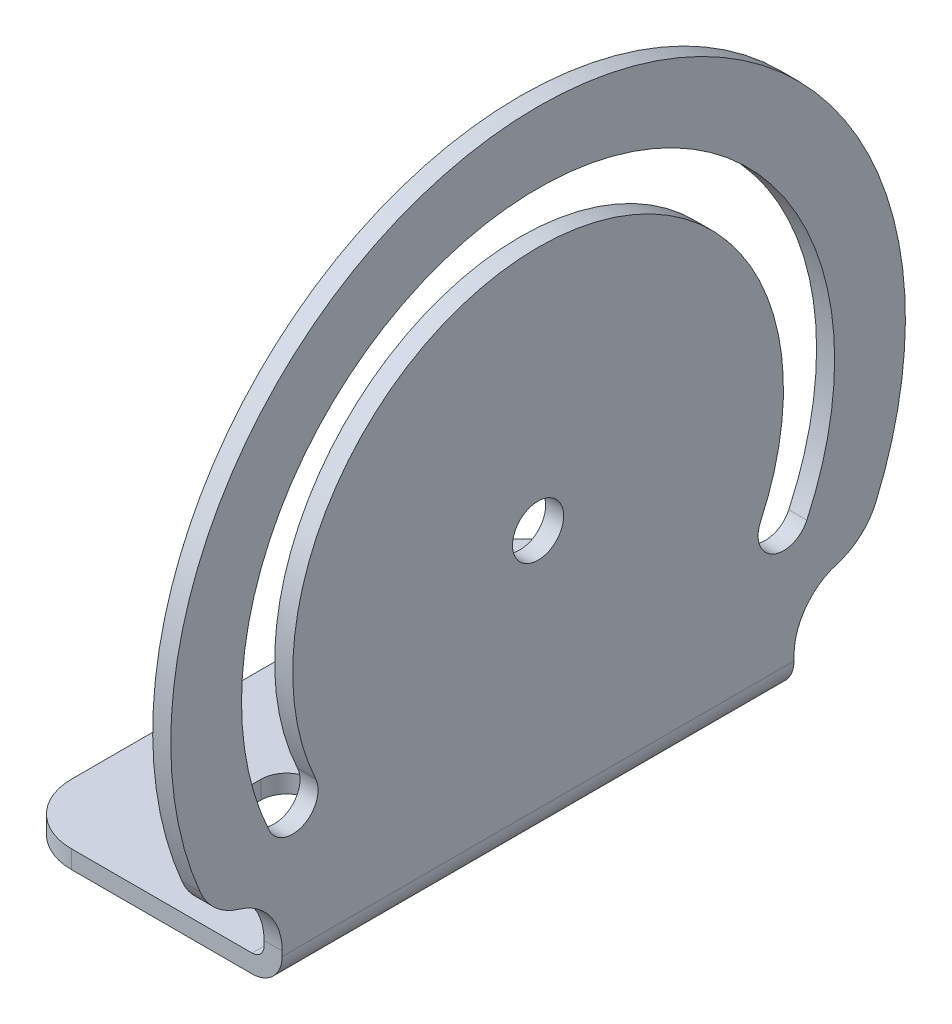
ISO-10303-21;
HEADER;
FILE_DESCRIPTION(('STEP AP214'),'2;1');
FILE_NAME('part.step','',(''),(''),'','','');
FILE_SCHEMA(('AUTOMOTIVE_DESIGN { 1 0 10303 214 1 1 1 1 }'));
ENDSEC;
DATA;
#1=APPLICATION_CONTEXT('core data for automotive mechanical design processes');
#2=APPLICATION_PROTOCOL_DEFINITION('international standard','automotive_design',2000,#1);
#3=PRODUCT_CONTEXT('',#1,'mechanical');
#4=PRODUCT('Part','Part','',(#3));
#5=PRODUCT_RELATED_PRODUCT_CATEGORY('part','',(#4));
#6=PRODUCT_DEFINITION_FORMATION('','',#4);
#7=PRODUCT_DEFINITION_CONTEXT('part definition',#1,'design');
#8=PRODUCT_DEFINITION('design','',#6,#7);
#9=PRODUCT_DEFINITION_SHAPE('','',#8);
#10=(LENGTH_UNIT() NAMED_UNIT(*) SI_UNIT(.MILLI.,.METRE.));
#11=(NAMED_UNIT(*) PLANE_ANGLE_UNIT() SI_UNIT($,.RADIAN.));
#12=(NAMED_UNIT(*) SI_UNIT($,.STERADIAN.) SOLID_ANGLE_UNIT());
#13=UNCERTAINTY_MEASURE_WITH_UNIT(LENGTH_MEASURE(1.E-05),#10,'distance_accuracy_value','');
#14=(GEOMETRIC_REPRESENTATION_CONTEXT(3) GLOBAL_UNCERTAINTY_ASSIGNED_CONTEXT((#13)) GLOBAL_UNIT_ASSIGNED_CONTEXT((#10,
#11,#12)) REPRESENTATION_CONTEXT('',''));
#15=CARTESIAN_POINT('',(0.,0.,0.));
#16=DIRECTION('',(0.,0.,1.));
#17=DIRECTION('',(1.,0.,0.));
#18=AXIS2_PLACEMENT_3D('',#15,#16,#17);
#19=CARTESIAN_POINT('',(-19.4999609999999,53.9776668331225,137.759426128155));
#20=DIRECTION('',(-1.,0.,0.));
#21=DIRECTION('',(0.,0.,1.));
#22=AXIS2_PLACEMENT_3D('',#19,#20,#21);
#23=PLANE('',#22);
#24=DIRECTION('',(0.,1.,0.));
#25=VECTOR('',#24,1.);
#26=CARTESIAN_POINT('',(-19.4999609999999,43.9776868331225,127.759446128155));
#27=LINE('',#26,#25);
#28=CARTESIAN_POINT('',(-19.4999609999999,46.9776808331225,127.759446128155));
#29=VERTEX_POINT('',#28);
#30=CARTESIAN_POINT('',(-19.4999609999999,43.9776868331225,127.759446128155));
#31=VERTEX_POINT('',#30);
#32=EDGE_CURVE('E237',#29,#31,#27,.F.);
#33=ORIENTED_EDGE('',*,*,#32,.F.);
#34=DIRECTION('',(0.,0.,1.));
#35=VECTOR('',#34,1.);
#36=CARTESIAN_POINT('',(-19.4999609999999,46.9776808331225,95.2595111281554));
#37=LINE('',#36,#35);
#38=CARTESIAN_POINT('',(-19.4999609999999,46.9776808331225,62.7595761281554));
#39=VERTEX_POINT('',#38);
#40=EDGE_CURVE('E296',#39,#29,#37,.T.);
#41=ORIENTED_EDGE('',*,*,#40,.F.);
#42=DIRECTION('',(0.,1.,0.));
#43=VECTOR('',#42,1.);
#44=CARTESIAN_POINT('',(-19.4999609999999,53.9776668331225,62.7595761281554));
#45=LINE('',#44,#43);
#46=CARTESIAN_POINT('',(-19.4999609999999,43.9776868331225,62.7595761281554));
#47=VERTEX_POINT('',#46);
#48=EDGE_CURVE('E239',#47,#39,#45,.T.);
#49=ORIENTED_EDGE('',*,*,#48,.F.);
#50=DIRECTION('',(0.,0.,1.));
#51=VECTOR('',#50,1.);
#52=CARTESIAN_POINT('',(-19.4999609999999,43.9776868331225,95.2595111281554));
#53=LINE('',#52,#51);
#54=EDGE_CURVE('E234',#47,#31,#53,.T.);
#55=ORIENTED_EDGE('',*,*,#54,.T.);
#56=EDGE_LOOP('',(#33,#41,#49,#55));
#57=FACE_BOUND('',#56,.T.);
#58=ADVANCED_FACE('F16',(#57),#23,.T.);
#59=CARTESIAN_POINT('',(-3.74999249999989,56.9776608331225,67.0095676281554));
#60=DIRECTION('',(-1.,0.,0.));
#61=DIRECTION('',(0.,0.,1.));
#62=AXIS2_PLACEMENT_3D('',#59,#60,#61);
#63=PLANE('',#62);
#64=DIRECTION('',(0.,-1.,0.));
#65=VECTOR('',#64,1.);
#66=CARTESIAN_POINT('',(-3.74999249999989,56.9776608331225,78.5095446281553));
#67=LINE('',#66,#65);
#68=CARTESIAN_POINT('',(-3.74999249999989,46.9776808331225,78.5095446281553));
#69=VERTEX_POINT('',#68);
#70=CARTESIAN_POINT('',(-3.74999249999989,43.9776868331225,78.5095446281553));
#71=VERTEX_POINT('',#70);
#72=EDGE_CURVE('E427',#69,#71,#67,.T.);
#73=ORIENTED_EDGE('',*,*,#72,.T.);
#74=DIRECTION('',(0.,0.,1.));
#75=VECTOR('',#74,1.);
#76=CARTESIAN_POINT('',(-3.74999249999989,43.9776868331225,95.2595111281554));
#77=LINE('',#76,#75);
#78=CARTESIAN_POINT('',(-3.74999249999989,43.9776868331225,67.0095676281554));
#79=VERTEX_POINT('',#78);
#80=EDGE_CURVE('E279',#71,#79,#77,.F.);
#81=ORIENTED_EDGE('',*,*,#80,.T.);
#82=DIRECTION('',(0.,-1.,0.));
#83=VECTOR('',#82,1.);
#84=CARTESIAN_POINT('',(-3.74999249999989,56.9776608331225,67.0095676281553));
#85=LINE('',#84,#83);
#86=CARTESIAN_POINT('',(-3.74999249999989,46.9776808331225,67.0095676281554));
#87=VERTEX_POINT('',#86);
#88=EDGE_CURVE('E421',#79,#87,#85,.F.);
#89=ORIENTED_EDGE('',*,*,#88,.T.);
#90=DIRECTION('',(0.,0.,1.));
#91=VECTOR('',#90,1.);
#92=CARTESIAN_POINT('',(-3.74999249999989,46.9776808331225,95.2595111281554));
#93=LINE('',#92,#91);
#94=EDGE_CURVE('E300',#69,#87,#93,.F.);
#95=ORIENTED_EDGE('',*,*,#94,.F.);
#96=EDGE_LOOP('',(#73,#81,#89,#95));
#97=FACE_BOUND('',#96,.T.);
#98=ADVANCED_FACE('F616',(#97),#63,.F.);
#99=CARTESIAN_POINT('',(0.499999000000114,56.9776608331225,67.0095676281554));
#100=DIRECTION('',(0.,-1.,0.));
#101=DIRECTION('',(1.,0.,0.));
#102=AXIS2_PLACEMENT_3D('',#99,#100,#101);
#103=CYLINDRICAL_SURFACE('',#102,4.2499915);
#104=ORIENTED_EDGE('',*,*,#88,.F.);
#105=CARTESIAN_POINT('',(0.499999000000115,43.9776868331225,67.0095676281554));
#106=DIRECTION('',(0.,-1.,0.));
#107=DIRECTION('',(1.,0.,0.));
#108=AXIS2_PLACEMENT_3D('',#105,#106,#107);
#109=CIRCLE('',#108,4.2499915);
#110=CARTESIAN_POINT('',(4.74999050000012,43.9776868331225,67.0095676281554));
#111=VERTEX_POINT('',#110);
#112=EDGE_CURVE('E261',#79,#111,#109,.T.);
#113=ORIENTED_EDGE('',*,*,#112,.T.);
#114=DIRECTION('',(0.,1.,0.));
#115=VECTOR('',#114,1.);
#116=CARTESIAN_POINT('',(4.74999050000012,56.9776608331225,67.0095676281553));
#117=LINE('',#116,#115);
#118=CARTESIAN_POINT('',(4.74999050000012,46.9776808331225,67.0095676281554));
#119=VERTEX_POINT('',#118);
#120=EDGE_CURVE('E424',#111,#119,#117,.T.);
#121=ORIENTED_EDGE('',*,*,#120,.T.);
#122=CARTESIAN_POINT('',(0.499999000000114,46.9776808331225,67.0095676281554));
#123=DIRECTION('',(0.,-1.,0.));
#124=DIRECTION('',(1.,0.,0.));
#125=AXIS2_PLACEMENT_3D('',#122,#123,#124);
#126=CIRCLE('',#125,4.2499915);
#127=EDGE_CURVE('E301',#87,#119,#126,.T.);
#128=ORIENTED_EDGE('',*,*,#127,.F.);
#129=EDGE_LOOP('',(#104,#113,#121,#128));
#130=FACE_BOUND('',#129,.T.);
#131=ADVANCED_FACE('F629',(#130),#103,.F.);
#132=CARTESIAN_POINT('',(4.74999050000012,56.9776608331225,78.5095446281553));
#133=DIRECTION('',(1.,0.,0.));
#134=DIRECTION('',(0.,0.,-1.));
#135=AXIS2_PLACEMENT_3D('',#132,#133,#134);
#136=PLANE('',#135);
#137=ORIENTED_EDGE('',*,*,#120,.F.);
#138=DIRECTION('',(0.,0.,1.));
#139=VECTOR('',#138,1.);
#140=CARTESIAN_POINT('',(4.74999050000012,43.9776868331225,95.2595111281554));
#141=LINE('',#140,#139);
#142=CARTESIAN_POINT('',(4.74999050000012,43.9776868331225,78.5095446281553));
#143=VERTEX_POINT('',#142);
#144=EDGE_CURVE('E266',#111,#143,#141,.T.);
#145=ORIENTED_EDGE('',*,*,#144,.T.);
#146=DIRECTION('',(0.,-1.,0.));
#147=VECTOR('',#146,1.);
#148=CARTESIAN_POINT('',(4.74999050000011,56.9776608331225,78.5095446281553));
#149=LINE('',#148,#147);
#150=CARTESIAN_POINT('',(4.74999050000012,46.9776808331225,78.5095446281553));
#151=VERTEX_POINT('',#150);
#152=EDGE_CURVE('E430',#143,#151,#149,.F.);
#153=ORIENTED_EDGE('',*,*,#152,.T.);
#154=DIRECTION('',(0.,0.,1.));
#155=VECTOR('',#154,1.);
#156=CARTESIAN_POINT('',(4.74999050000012,46.9776808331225,95.2595111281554));
#157=LINE('',#156,#155);
#158=EDGE_CURVE('E305',#119,#151,#157,.T.);
#159=ORIENTED_EDGE('',*,*,#158,.F.);
#160=EDGE_LOOP('',(#137,#145,#153,#159));
#161=FACE_BOUND('',#160,.T.);
#162=ADVANCED_FACE('F626',(#161),#136,.F.);
#163=CARTESIAN_POINT('',(0.499999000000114,56.9776608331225,78.5095446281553));
#164=DIRECTION('',(0.,-1.,0.));
#165=DIRECTION('',(1.,0.,0.));
#166=AXIS2_PLACEMENT_3D('',#163,#164,#165);
#167=CYLINDRICAL_SURFACE('',#166,4.2499915);
#168=ORIENTED_EDGE('',*,*,#152,.F.);
#169=CARTESIAN_POINT('',(0.499999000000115,43.9776868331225,78.5095446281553));
#170=DIRECTION('',(0.,-1.,0.));
#171=DIRECTION('',(1.,0.,0.));
#172=AXIS2_PLACEMENT_3D('',#169,#170,#171);
#173=CIRCLE('',#172,4.2499915);
#174=EDGE_CURVE('E273',#143,#71,#173,.T.);
#175=ORIENTED_EDGE('',*,*,#174,.T.);
#176=ORIENTED_EDGE('',*,*,#72,.F.);
#177=CARTESIAN_POINT('',(0.499999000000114,46.9776808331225,78.5095446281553));
#178=DIRECTION('',(0.,-1.,0.));
#179=DIRECTION('',(1.,0.,0.));
#180=AXIS2_PLACEMENT_3D('',#177,#178,#179);
#181=CIRCLE('',#180,4.2499915);
#182=EDGE_CURVE('E306',#151,#69,#181,.T.);
#183=ORIENTED_EDGE('',*,*,#182,.F.);
#184=EDGE_LOOP('',(#168,#175,#176,#183));
#185=FACE_BOUND('',#184,.T.);
#186=ADVANCED_FACE('F628',(#185),#167,.F.);
#187=CARTESIAN_POINT('',(-3.74999249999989,56.9776608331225,112.009477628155));
#188=DIRECTION('',(-1.,0.,0.));
#189=DIRECTION('',(0.,0.,1.));
#190=AXIS2_PLACEMENT_3D('',#187,#188,#189);
#191=PLANE('',#190);
#192=DIRECTION('',(0.,-1.,0.));
#193=VECTOR('',#192,1.);
#194=CARTESIAN_POINT('',(-3.74999249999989,56.9776608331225,123.509454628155));
#195=LINE('',#194,#193);
#196=CARTESIAN_POINT('',(-3.74999249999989,46.9776808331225,123.509454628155));
#197=VERTEX_POINT('',#196);
#198=CARTESIAN_POINT('',(-3.74999249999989,43.9776868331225,123.509454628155));
#199=VERTEX_POINT('',#198);
#200=EDGE_CURVE('E438',#197,#199,#195,.T.);
#201=ORIENTED_EDGE('',*,*,#200,.T.);
#202=DIRECTION('',(0.,0.,1.));
#203=VECTOR('',#202,1.);
#204=CARTESIAN_POINT('',(-3.74999249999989,43.9776868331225,95.2595111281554));
#205=LINE('',#204,#203);
#206=CARTESIAN_POINT('',(-3.74999249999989,43.9776868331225,112.009477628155));
#207=VERTEX_POINT('',#206);
#208=EDGE_CURVE('E288',#199,#207,#205,.F.);
#209=ORIENTED_EDGE('',*,*,#208,.T.);
#210=DIRECTION('',(0.,-1.,0.));
#211=VECTOR('',#210,1.);
#212=CARTESIAN_POINT('',(-3.74999249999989,56.9776608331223,112.009477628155));
#213=LINE('',#212,#211);
#214=CARTESIAN_POINT('',(-3.74999249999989,46.9776808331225,112.009477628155));
#215=VERTEX_POINT('',#214);
#216=EDGE_CURVE('E433',#207,#215,#213,.F.);
#217=ORIENTED_EDGE('',*,*,#216,.T.);
#218=DIRECTION('',(0.,0.,1.));
#219=VECTOR('',#218,1.);
#220=CARTESIAN_POINT('',(-3.74999249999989,46.9776808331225,95.2595111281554));
#221=LINE('',#220,#219);
#222=EDGE_CURVE('E310',#197,#215,#221,.F.);
#223=ORIENTED_EDGE('',*,*,#222,.F.);
#224=EDGE_LOOP('',(#201,#209,#217,#223));
#225=FACE_BOUND('',#224,.T.);
#226=ADVANCED_FACE('F646',(#225),#191,.F.);
#227=CARTESIAN_POINT('',(0.499999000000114,56.9776608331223,112.009477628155));
#228=DIRECTION('',(0.,-1.,0.));
#229=DIRECTION('',(1.,0.,0.));
#230=AXIS2_PLACEMENT_3D('',#227,#228,#229);
#231=CYLINDRICAL_SURFACE('',#230,4.2499915);
#232=ORIENTED_EDGE('',*,*,#216,.F.);
#233=CARTESIAN_POINT('',(0.499999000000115,43.9776868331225,112.009477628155));
#234=DIRECTION('',(0.,-1.,0.));
#235=DIRECTION('',(1.,0.,0.));
#236=AXIS2_PLACEMENT_3D('',#233,#234,#235);
#237=CIRCLE('',#236,4.2499915);
#238=CARTESIAN_POINT('',(4.74999050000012,43.9776868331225,112.009477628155));
#239=VERTEX_POINT('',#238);
#240=EDGE_CURVE('E280',#207,#239,#237,.T.);
#241=ORIENTED_EDGE('',*,*,#240,.T.);
#242=DIRECTION('',(0.,1.,0.));
#243=VECTOR('',#242,1.);
#244=CARTESIAN_POINT('',(4.74999050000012,56.9776608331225,112.009477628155));
#245=LINE('',#244,#243);
#246=CARTESIAN_POINT('',(4.74999050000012,46.9776808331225,112.009477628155));
#247=VERTEX_POINT('',#246);
#248=EDGE_CURVE('E435',#239,#247,#245,.T.);
#249=ORIENTED_EDGE('',*,*,#248,.T.);
#250=CARTESIAN_POINT('',(0.499999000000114,46.9776808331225,112.009477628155));
#251=DIRECTION('',(0.,-1.,0.));
#252=DIRECTION('',(1.,0.,0.));
#253=AXIS2_PLACEMENT_3D('',#250,#251,#252);
#254=CIRCLE('',#253,4.2499915);
#255=EDGE_CURVE('E311',#215,#247,#254,.T.);
#256=ORIENTED_EDGE('',*,*,#255,.F.);
#257=EDGE_LOOP('',(#232,#241,#249,#256));
#258=FACE_BOUND('',#257,.T.);
#259=ADVANCED_FACE('F654',(#258),#231,.F.);
#260=CARTESIAN_POINT('',(4.74999050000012,56.9776608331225,123.509454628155));
#261=DIRECTION('',(1.,0.,0.));
#262=DIRECTION('',(0.,0.,-1.));
#263=AXIS2_PLACEMENT_3D('',#260,#261,#262);
#264=PLANE('',#263);
#265=ORIENTED_EDGE('',*,*,#248,.F.);
#266=DIRECTION('',(0.,0.,1.));
#267=VECTOR('',#266,1.);
#268=CARTESIAN_POINT('',(4.74999050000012,43.9776868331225,95.2595111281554));
#269=LINE('',#268,#267);
#270=CARTESIAN_POINT('',(4.74999050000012,43.9776868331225,123.509454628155));
#271=VERTEX_POINT('',#270);
#272=EDGE_CURVE('E283',#239,#271,#269,.T.);
#273=ORIENTED_EDGE('',*,*,#272,.T.);
#274=DIRECTION('',(0.,-1.,0.));
#275=VECTOR('',#274,1.);
#276=CARTESIAN_POINT('',(4.74999050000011,56.9776608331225,123.509454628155));
#277=LINE('',#276,#275);
#278=CARTESIAN_POINT('',(4.74999050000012,46.9776808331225,123.509454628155));
#279=VERTEX_POINT('',#278);
#280=EDGE_CURVE('E253',#271,#279,#277,.F.);
#281=ORIENTED_EDGE('',*,*,#280,.T.);
#282=DIRECTION('',(0.,0.,1.));
#283=VECTOR('',#282,1.);
#284=CARTESIAN_POINT('',(4.74999050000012,46.9776808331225,95.2595111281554));
#285=LINE('',#284,#283);
#286=EDGE_CURVE('E315',#247,#279,#285,.T.);
#287=ORIENTED_EDGE('',*,*,#286,.F.);
#288=EDGE_LOOP('',(#265,#273,#281,#287));
#289=FACE_BOUND('',#288,.T.);
#290=ADVANCED_FACE('F591',(#289),#264,.F.);
#291=CARTESIAN_POINT('',(0.499999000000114,56.9776608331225,123.509454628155));
#292=DIRECTION('',(0.,-1.,0.));
#293=DIRECTION('',(1.,0.,0.));
#294=AXIS2_PLACEMENT_3D('',#291,#292,#293);
#295=CYLINDRICAL_SURFACE('',#294,4.2499915);
#296=ORIENTED_EDGE('',*,*,#280,.F.);
#297=CARTESIAN_POINT('',(0.499999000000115,43.9776868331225,123.509454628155));
#298=DIRECTION('',(0.,-1.,0.));
#299=DIRECTION('',(1.,0.,0.));
#300=AXIS2_PLACEMENT_3D('',#297,#298,#299);
#301=CIRCLE('',#300,4.2499915);
#302=EDGE_CURVE('E284',#271,#199,#301,.T.);
#303=ORIENTED_EDGE('',*,*,#302,.T.);
#304=ORIENTED_EDGE('',*,*,#200,.F.);
#305=CARTESIAN_POINT('',(0.499999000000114,46.9776808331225,123.509454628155));
#306=DIRECTION('',(0.,-1.,0.));
#307=DIRECTION('',(1.,0.,0.));
#308=AXIS2_PLACEMENT_3D('',#305,#306,#307);
#309=CIRCLE('',#308,4.2499915);
#310=EDGE_CURVE('E316',#279,#197,#309,.T.);
#311=ORIENTED_EDGE('',*,*,#310,.F.);
#312=EDGE_LOOP('',(#296,#303,#304,#311));
#313=FACE_BOUND('',#312,.T.);
#314=ADVANCED_FACE('F588',(#313),#295,.F.);
#315=CARTESIAN_POINT('',(-9.49998099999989,43.9776868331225,127.759446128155));
#316=DIRECTION('',(0.,1.,0.));
#317=DIRECTION('',(-1.,0.,0.));
#318=AXIS2_PLACEMENT_3D('',#315,#316,#317);
#319=CYLINDRICAL_SURFACE('',#318,9.99998);
#320=CARTESIAN_POINT('',(-9.49998099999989,43.9776868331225,127.759446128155));
#321=DIRECTION('',(0.,1.,0.));
#322=DIRECTION('',(-1.,0.,0.));
#323=AXIS2_PLACEMENT_3D('',#320,#321,#322);
#324=CIRCLE('',#323,9.99998);
#325=CARTESIAN_POINT('',(-9.49998099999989,43.9776868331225,137.759426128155));
#326=VERTEX_POINT('',#325);
#327=EDGE_CURVE('E19',#31,#326,#324,.T.);
#328=ORIENTED_EDGE('',*,*,#327,.T.);
#329=DIRECTION('',(0.,1.,0.));
#330=VECTOR('',#329,1.);
#331=CARTESIAN_POINT('',(-9.49998099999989,48.9776768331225,137.759426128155));
#332=LINE('',#331,#330);
#333=CARTESIAN_POINT('',(-9.49998099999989,46.9776808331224,137.759426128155));
#334=VERTEX_POINT('',#333);
#335=EDGE_CURVE('E443',#334,#326,#332,.F.);
#336=ORIENTED_EDGE('',*,*,#335,.F.);
#337=CARTESIAN_POINT('',(-9.49998099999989,46.9776808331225,127.759446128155));
#338=DIRECTION('',(0.,1.,0.));
#339=DIRECTION('',(-1.,0.,0.));
#340=AXIS2_PLACEMENT_3D('',#337,#338,#339);
#341=CIRCLE('',#340,9.99998);
#342=EDGE_CURVE('E250',#29,#334,#341,.T.);
#343=ORIENTED_EDGE('',*,*,#342,.F.);
#344=ORIENTED_EDGE('',*,*,#32,.T.);
#345=EDGE_LOOP('',(#328,#336,#343,#344));
#346=FACE_BOUND('',#345,.T.);
#347=ADVANCED_FACE('F247',(#346),#319,.T.);
#348=CARTESIAN_POINT('',(2.99999400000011,43.9776868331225,95.2595111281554));
#349=DIRECTION('',(0.,1.,0.));
#350=DIRECTION('',(0.,0.,1.));
#351=AXIS2_PLACEMENT_3D('',#348,#349,#350);
#352=PLANE('',#351);
#353=ORIENTED_EDGE('',*,*,#302,.F.);
#354=ORIENTED_EDGE('',*,*,#272,.F.);
#355=ORIENTED_EDGE('',*,*,#240,.F.);
#356=ORIENTED_EDGE('',*,*,#208,.F.);
#357=EDGE_LOOP('',(#353,#354,#355,#356));
#358=FACE_BOUND('',#357,.T.);
#359=ORIENTED_EDGE('',*,*,#174,.F.);
#360=ORIENTED_EDGE('',*,*,#144,.F.);
#361=ORIENTED_EDGE('',*,*,#112,.F.);
#362=ORIENTED_EDGE('',*,*,#80,.F.);
#363=EDGE_LOOP('',(#359,#360,#361,#362));
#364=FACE_BOUND('',#363,.T.);
#365=DIRECTION('',(-1.,0.,0.));
#366=VECTOR('',#365,1.);
#367=CARTESIAN_POINT('',(22.4999550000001,43.9776868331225,52.7595961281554));
#368=LINE('',#367,#366);
#369=CARTESIAN_POINT('',(20.4999590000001,43.9776868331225,52.7595961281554));
#370=VERTEX_POINT('',#369);
#371=CARTESIAN_POINT('',(-9.49998099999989,43.9776868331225,52.7595961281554));
#372=VERTEX_POINT('',#371);
#373=EDGE_CURVE('E328',#370,#372,#368,.T.);
#374=ORIENTED_EDGE('',*,*,#373,.F.);
#375=DIRECTION('',(0.,0.,-1.));
#376=VECTOR('',#375,1.);
#377=CARTESIAN_POINT('',(20.4999590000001,43.9776868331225,74.0095536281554));
#378=LINE('',#377,#376);
#379=CARTESIAN_POINT('',(20.4999590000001,43.9776868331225,137.759426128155));
#380=VERTEX_POINT('',#379);
#381=EDGE_CURVE('E297',#380,#370,#378,.T.);
#382=ORIENTED_EDGE('',*,*,#381,.F.);
#383=DIRECTION('',(1.,0.,0.));
#384=VECTOR('',#383,1.);
#385=CARTESIAN_POINT('',(22.4999550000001,43.9776868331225,137.759426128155));
#386=LINE('',#385,#384);
#387=EDGE_CURVE('E258',#326,#380,#386,.T.);
#388=ORIENTED_EDGE('',*,*,#387,.F.);
#389=ORIENTED_EDGE('',*,*,#327,.F.);
#390=ORIENTED_EDGE('',*,*,#54,.F.);
#391=CARTESIAN_POINT('',(-9.49998099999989,43.9776868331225,62.7595761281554));
#392=DIRECTION('',(0.,1.,0.));
#393=DIRECTION('',(-1.,0.,0.));
#394=AXIS2_PLACEMENT_3D('',#391,#392,#393);
#395=CIRCLE('',#394,9.99998);
#396=EDGE_CURVE('E289',#372,#47,#395,.T.);
#397=ORIENTED_EDGE('',*,*,#396,.F.);
#398=EDGE_LOOP('',(#374,#382,#388,#389,#390,#397));
#399=FACE_BOUND('',#398,.T.);
#400=ADVANCED_FACE('F256',(#358,#364,#399),#352,.F.);
#401=CARTESIAN_POINT('',(-9.49998099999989,53.9776668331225,62.7595761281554));
#402=DIRECTION('',(0.,1.,0.));
#403=DIRECTION('',(-1.,0.,0.));
#404=AXIS2_PLACEMENT_3D('',#401,#402,#403);
#405=CYLINDRICAL_SURFACE('',#404,9.99998);
#406=ORIENTED_EDGE('',*,*,#396,.T.);
#407=ORIENTED_EDGE('',*,*,#48,.T.);
#408=CARTESIAN_POINT('',(-9.49998099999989,46.9776808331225,62.7595761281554));
#409=DIRECTION('',(0.,1.,0.));
#410=DIRECTION('',(-1.,0.,0.));
#411=AXIS2_PLACEMENT_3D('',#408,#409,#410);
#412=CIRCLE('',#411,9.99998);
#413=CARTESIAN_POINT('',(-9.49998099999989,46.9776808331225,52.7595961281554));
#414=VERTEX_POINT('',#413);
#415=EDGE_CURVE('E292',#414,#39,#412,.T.);
#416=ORIENTED_EDGE('',*,*,#415,.F.);
#417=DIRECTION('',(0.,1.,0.));
#418=VECTOR('',#417,1.);
#419=CARTESIAN_POINT('',(-9.49998099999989,58.9776568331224,52.7595961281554));
#420=LINE('',#419,#418);
#421=EDGE_CURVE('E456',#372,#414,#420,.T.);
#422=ORIENTED_EDGE('',*,*,#421,.F.);
#423=EDGE_LOOP('',(#406,#407,#416,#422));
#424=FACE_BOUND('',#423,.T.);
#425=ADVANCED_FACE('F581',(#424),#405,.T.);
#426=CARTESIAN_POINT('',(20.4999590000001,48.9776768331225,74.0095536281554));
#427=DIRECTION('',(0.,0.,-1.));
#428=DIRECTION('',(-1.,0.,0.));
#429=AXIS2_PLACEMENT_3D('',#426,#427,#428);
#430=CYLINDRICAL_SURFACE('',#429,4.99999);
#431=ORIENTED_EDGE('',*,*,#381,.T.);
#432=CARTESIAN_POINT('',(20.4999590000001,48.9776768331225,52.7595961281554));
#433=DIRECTION('',(0.,0.,-1.));
#434=DIRECTION('',(-1.,0.,0.));
#435=AXIS2_PLACEMENT_3D('',#432,#433,#434);
#436=CIRCLE('',#435,4.99999);
#437=CARTESIAN_POINT('',(25.4999490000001,48.9776768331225,52.7595961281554));
#438=VERTEX_POINT('',#437);
#439=EDGE_CURVE('E324',#438,#370,#436,.T.);
#440=ORIENTED_EDGE('',*,*,#439,.F.);
#441=DIRECTION('',(0.,0.,1.));
#442=VECTOR('',#441,1.);
#443=CARTESIAN_POINT('',(25.4999490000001,48.9776768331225,95.2595111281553));
#444=LINE('',#443,#442);
#445=CARTESIAN_POINT('',(25.4999490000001,48.9776768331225,137.759426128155));
#446=VERTEX_POINT('',#445);
#447=EDGE_CURVE('E460',#438,#446,#444,.T.);
#448=ORIENTED_EDGE('',*,*,#447,.T.);
#449=CARTESIAN_POINT('',(20.4999590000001,48.9776768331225,137.759426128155));
#450=DIRECTION('',(0.,0.,-1.));
#451=DIRECTION('',(-1.,0.,0.));
#452=AXIS2_PLACEMENT_3D('',#449,#450,#451);
#453=CIRCLE('',#452,4.99999);
#454=EDGE_CURVE('E321',#380,#446,#453,.F.);
#455=ORIENTED_EDGE('',*,*,#454,.F.);
#456=EDGE_LOOP('',(#431,#440,#448,#455));
#457=FACE_BOUND('',#456,.T.);
#458=ADVANCED_FACE('F572',(#457),#430,.T.);
#459=CARTESIAN_POINT('',(2.99999400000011,46.9776808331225,95.2595111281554));
#460=DIRECTION('',(0.,1.,0.));
#461=DIRECTION('',(0.,0.,1.));
#462=AXIS2_PLACEMENT_3D('',#459,#460,#461);
#463=PLANE('',#462);
#464=ORIENTED_EDGE('',*,*,#286,.T.);
#465=ORIENTED_EDGE('',*,*,#310,.T.);
#466=ORIENTED_EDGE('',*,*,#222,.T.);
#467=ORIENTED_EDGE('',*,*,#255,.T.);
#468=EDGE_LOOP('',(#464,#465,#466,#467));
#469=FACE_BOUND('',#468,.T.);
#470=ORIENTED_EDGE('',*,*,#158,.T.);
#471=ORIENTED_EDGE('',*,*,#182,.T.);
#472=ORIENTED_EDGE('',*,*,#94,.T.);
#473=ORIENTED_EDGE('',*,*,#127,.T.);
#474=EDGE_LOOP('',(#470,#471,#472,#473));
#475=FACE_BOUND('',#474,.T.);
#476=DIRECTION('',(0.,0.,-1.));
#477=VECTOR('',#476,1.);
#478=CARTESIAN_POINT('',(20.4999590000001,46.9776808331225,95.2595111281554));
#479=LINE('',#478,#477);
#480=CARTESIAN_POINT('',(20.4999590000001,46.9776808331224,137.759426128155));
#481=VERTEX_POINT('',#480);
#482=CARTESIAN_POINT('',(20.4999590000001,46.9776808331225,52.7595961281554));
#483=VERTEX_POINT('',#482);
#484=EDGE_CURVE('E334',#481,#483,#479,.T.);
#485=ORIENTED_EDGE('',*,*,#484,.T.);
#486=DIRECTION('',(-1.,0.,0.));
#487=VECTOR('',#486,1.);
#488=CARTESIAN_POINT('',(22.4999550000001,46.9776808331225,52.7595961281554));
#489=LINE('',#488,#487);
#490=EDGE_CURVE('E459',#414,#483,#489,.F.);
#491=ORIENTED_EDGE('',*,*,#490,.F.);
#492=ORIENTED_EDGE('',*,*,#415,.T.);
#493=ORIENTED_EDGE('',*,*,#40,.T.);
#494=ORIENTED_EDGE('',*,*,#342,.T.);
#495=DIRECTION('',(1.,0.,0.));
#496=VECTOR('',#495,1.);
#497=CARTESIAN_POINT('',(22.4999550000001,46.9776808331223,137.759426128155));
#498=LINE('',#497,#496);
#499=EDGE_CURVE('E445',#481,#334,#498,.F.);
#500=ORIENTED_EDGE('',*,*,#499,.F.);
#501=EDGE_LOOP('',(#485,#491,#492,#493,#494,#500));
#502=FACE_BOUND('',#501,.T.);
#503=ADVANCED_FACE('F568',(#469,#475,#502),#463,.T.);
#504=CARTESIAN_POINT('',(22.4999550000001,48.9776768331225,137.759426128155));
#505=DIRECTION('',(0.,0.,1.));
#506=DIRECTION('',(1.,0.,0.));
#507=AXIS2_PLACEMENT_3D('',#504,#505,#506);
#508=PLANE('',#507);
#509=ORIENTED_EDGE('',*,*,#454,.T.);
#510=DIRECTION('',(0.,1.,0.));
#511=VECTOR('',#510,1.);
#512=CARTESIAN_POINT('',(25.4999490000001,89.9618842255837,137.759426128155));
#513=LINE('',#512,#511);
#514=CARTESIAN_POINT('',(25.4999490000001,49.7733599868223,137.759426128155));
#515=VERTEX_POINT('',#514);
#516=EDGE_CURVE('E463',#446,#515,#513,.T.);
#517=ORIENTED_EDGE('',*,*,#516,.T.);
#518=DIRECTION('',(1.,0.,0.));
#519=VECTOR('',#518,1.);
#520=CARTESIAN_POINT('',(22.4999550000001,49.7733599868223,137.759426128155));
#521=LINE('',#520,#519);
#522=CARTESIAN_POINT('',(22.4999550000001,49.7733599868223,137.759426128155));
#523=VERTEX_POINT('',#522);
#524=EDGE_CURVE('E338',#515,#523,#521,.F.);
#525=ORIENTED_EDGE('',*,*,#524,.T.);
#526=DIRECTION('',(0.,1.,0.));
#527=VECTOR('',#526,1.);
#528=CARTESIAN_POINT('',(22.4999550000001,48.9776768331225,137.759426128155));
#529=LINE('',#528,#527);
#530=CARTESIAN_POINT('',(22.4999550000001,48.9776768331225,137.759426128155));
#531=VERTEX_POINT('',#530);
#532=EDGE_CURVE('E320',#523,#531,#529,.F.);
#533=ORIENTED_EDGE('',*,*,#532,.T.);
#534=CARTESIAN_POINT('',(20.4999590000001,48.9776768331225,137.759426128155));
#535=DIRECTION('',(0.,0.,-1.));
#536=DIRECTION('',(-1.,0.,0.));
#537=AXIS2_PLACEMENT_3D('',#534,#535,#536);
#538=CIRCLE('',#537,1.999996);
#539=EDGE_CURVE('E333',#531,#481,#538,.T.);
#540=ORIENTED_EDGE('',*,*,#539,.T.);
#541=ORIENTED_EDGE('',*,*,#499,.T.);
#542=ORIENTED_EDGE('',*,*,#335,.T.);
#543=ORIENTED_EDGE('',*,*,#387,.T.);
#544=EDGE_LOOP('',(#509,#517,#525,#533,#540,#541,#542,#543));
#545=FACE_BOUND('',#544,.T.);
#546=ADVANCED_FACE('F571',(#545),#508,.T.);
#547=CARTESIAN_POINT('',(22.4999550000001,58.9776568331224,52.7595961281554));
#548=DIRECTION('',(0.,0.,-1.));
#549=DIRECTION('',(-1.,0.,0.));
#550=AXIS2_PLACEMENT_3D('',#547,#548,#549);
#551=PLANE('',#550);
#552=CARTESIAN_POINT('',(20.4999590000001,48.9776768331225,52.7595961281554));
#553=DIRECTION('',(0.,0.,-1.));
#554=DIRECTION('',(-1.,0.,0.));
#555=AXIS2_PLACEMENT_3D('',#552,#553,#554);
#556=CIRCLE('',#555,1.999996);
#557=CARTESIAN_POINT('',(22.4999550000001,48.9776768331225,52.7595961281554));
#558=VERTEX_POINT('',#557);
#559=EDGE_CURVE('E329',#483,#558,#556,.F.);
#560=ORIENTED_EDGE('',*,*,#559,.T.);
#561=DIRECTION('',(0.,1.,0.));
#562=VECTOR('',#561,1.);
#563=CARTESIAN_POINT('',(22.4999550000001,58.9776568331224,52.7595961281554));
#564=LINE('',#563,#562);
#565=CARTESIAN_POINT('',(22.4999550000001,49.7733599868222,52.7595961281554));
#566=VERTEX_POINT('',#565);
#567=EDGE_CURVE('E496',#558,#566,#564,.T.);
#568=ORIENTED_EDGE('',*,*,#567,.T.);
#569=DIRECTION('',(-1.,0.,0.));
#570=VECTOR('',#569,1.);
#571=CARTESIAN_POINT('',(22.4999550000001,49.7733599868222,52.7595961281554));
#572=LINE('',#571,#570);
#573=CARTESIAN_POINT('',(25.4999490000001,49.7733599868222,52.7595961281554));
#574=VERTEX_POINT('',#573);
#575=EDGE_CURVE('E356',#566,#574,#572,.F.);
#576=ORIENTED_EDGE('',*,*,#575,.T.);
#577=DIRECTION('',(0.,1.,0.));
#578=VECTOR('',#577,1.);
#579=CARTESIAN_POINT('',(25.4999490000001,89.9618842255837,52.7595961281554));
#580=LINE('',#579,#578);
#581=EDGE_CURVE('E464',#574,#438,#580,.F.);
#582=ORIENTED_EDGE('',*,*,#581,.T.);
#583=ORIENTED_EDGE('',*,*,#439,.T.);
#584=ORIENTED_EDGE('',*,*,#373,.T.);
#585=ORIENTED_EDGE('',*,*,#421,.T.);
#586=ORIENTED_EDGE('',*,*,#490,.T.);
#587=EDGE_LOOP('',(#560,#568,#576,#582,#583,#584,#585,#586));
#588=FACE_BOUND('',#587,.T.);
#589=ADVANCED_FACE('F620',(#588),#551,.T.);
#590=CARTESIAN_POINT('',(25.4999490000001,89.9618842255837,95.2595111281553));
#591=DIRECTION('',(-1.,0.,0.));
#592=DIRECTION('',(0.,0.,1.));
#593=AXIS2_PLACEMENT_3D('',#590,#591,#592);
#594=PLANE('',#593);
#595=CARTESIAN_POINT('',(25.4999490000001,69.9598130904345,136.043279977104));
#596=DIRECTION('',(1.,0.,0.));
#597=DIRECTION('',(0.,0.,-1.));
#598=AXIS2_PLACEMENT_3D('',#595,#596,#597);
#599=CIRCLE('',#598,4.2499915);
#600=CARTESIAN_POINT('',(25.4999490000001,71.7559371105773,132.191479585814));
#601=VERTEX_POINT('',#600);
#602=CARTESIAN_POINT('',(25.4999490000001,68.1636890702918,139.895080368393));
#603=VERTEX_POINT('',#602);
#604=EDGE_CURVE('E378',#601,#603,#599,.F.);
#605=ORIENTED_EDGE('',*,*,#604,.T.);
#606=CARTESIAN_POINT('',(25.4999490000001,88.9775968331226,95.2595111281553));
#607=DIRECTION('',(1.,0.,0.));
#608=DIRECTION('',(0.,0.,-1.));
#609=AXIS2_PLACEMENT_3D('',#606,#607,#608);
#610=CIRCLE('',#609,49.2499015);
#611=CARTESIAN_POINT('',(25.4999490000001,68.1636890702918,50.6239418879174));
#612=VERTEX_POINT('',#611);
#613=EDGE_CURVE('E374',#603,#612,#610,.F.);
#614=ORIENTED_EDGE('',*,*,#613,.T.);
#615=CARTESIAN_POINT('',(25.4999490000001,69.9598130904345,54.4757422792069));
#616=DIRECTION('',(1.,0.,0.));
#617=DIRECTION('',(0.,0.,-1.));
#618=AXIS2_PLACEMENT_3D('',#615,#616,#617);
#619=CIRCLE('',#618,4.2499915);
#620=CARTESIAN_POINT('',(25.4999490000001,71.7559371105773,58.3275426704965));
#621=VERTEX_POINT('',#620);
#622=EDGE_CURVE('E369',#612,#621,#619,.F.);
#623=ORIENTED_EDGE('',*,*,#622,.T.);
#624=CARTESIAN_POINT('',(25.4999490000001,88.9775968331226,95.2595111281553));
#625=DIRECTION('',(1.,0.,0.));
#626=DIRECTION('',(0.,0.,-1.));
#627=AXIS2_PLACEMENT_3D('',#624,#625,#626);
#628=CIRCLE('',#627,40.7499185);
#629=EDGE_CURVE('E365',#601,#621,#628,.F.);
#630=ORIENTED_EDGE('',*,*,#629,.F.);
#631=EDGE_LOOP('',(#605,#614,#623,#630));
#632=FACE_BOUND('',#631,.T.);
#633=CARTESIAN_POINT('',(25.4999490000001,88.9775968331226,95.2595111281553));
#634=DIRECTION('',(1.,0.,0.));
#635=DIRECTION('',(0.,0.,-1.));
#636=AXIS2_PLACEMENT_3D('',#633,#634,#635);
#637=CIRCLE('',#636,4.2499915);
#638=CARTESIAN_POINT('',(25.4999490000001,88.9775968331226,91.0095196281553));
#639=VERTEX_POINT('',#638);
#640=EDGE_CURVE('E361',#639,#639,#637,.F.);
#641=ORIENTED_EDGE('',*,*,#640,.T.);
#642=EDGE_LOOP('',(#641));
#643=FACE_BOUND('',#642,.T.);
#644=CARTESIAN_POINT('',(25.4999490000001,88.9775968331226,95.2595111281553));
#645=DIRECTION('',(1.,0.,0.));
#646=DIRECTION('',(0.,0.,-1.));
#647=AXIS2_PLACEMENT_3D('',#644,#645,#646);
#648=CIRCLE('',#647,60.999878);
#649=CARTESIAN_POINT('',(25.4999490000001,65.0560760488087,151.37319893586));
#650=VERTEX_POINT('',#649);
#651=CARTESIAN_POINT('',(25.4999490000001,65.0560760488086,39.1458233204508));
#652=VERTEX_POINT('',#651);
#653=EDGE_CURVE('E348',#650,#652,#648,.F.);
#654=ORIENTED_EDGE('',*,*,#653,.F.);
#655=CARTESIAN_POINT('',(25.4999490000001,68.9776368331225,142.174233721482));
#656=DIRECTION('',(1.,0.,0.));
#657=DIRECTION('',(0.,0.,-1.));
#658=AXIS2_PLACEMENT_3D('',#655,#656,#657);
#659=CIRCLE('',#658,9.99998);
#660=CARTESIAN_POINT('',(25.4999490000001,59.3754984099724,144.966819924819));
#661=VERTEX_POINT('',#660);
#662=EDGE_CURVE('E344',#661,#650,#659,.F.);
#663=ORIENTED_EDGE('',*,*,#662,.F.);
#664=CARTESIAN_POINT('',(25.4999490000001,49.7733599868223,147.759406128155));
#665=DIRECTION('',(1.,0.,0.));
#666=DIRECTION('',(0.,0.,-1.));
#667=AXIS2_PLACEMENT_3D('',#664,#665,#666);
#668=CIRCLE('',#667,9.99998);
#669=EDGE_CURVE('E339',#661,#515,#668,.F.);
#670=ORIENTED_EDGE('',*,*,#669,.T.);
#671=ORIENTED_EDGE('',*,*,#516,.F.);
#672=ORIENTED_EDGE('',*,*,#447,.F.);
#673=ORIENTED_EDGE('',*,*,#581,.F.);
#674=CARTESIAN_POINT('',(25.4999490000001,49.7733599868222,42.7596161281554));
#675=DIRECTION('',(-1.,0.,0.));
#676=DIRECTION('',(0.,0.,1.));
#677=AXIS2_PLACEMENT_3D('',#674,#675,#676);
#678=CIRCLE('',#677,9.99998);
#679=CARTESIAN_POINT('',(25.4999490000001,59.3754984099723,45.552202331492));
#680=VERTEX_POINT('',#679);
#681=EDGE_CURVE('E357',#574,#680,#678,.T.);
#682=ORIENTED_EDGE('',*,*,#681,.T.);
#683=CARTESIAN_POINT('',(25.4999490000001,68.9776368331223,48.3447885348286));
#684=DIRECTION('',(1.,0.,0.));
#685=DIRECTION('',(0.,0.,-1.));
#686=AXIS2_PLACEMENT_3D('',#683,#684,#685);
#687=CIRCLE('',#686,9.99998);
#688=EDGE_CURVE('E352',#652,#680,#687,.F.);
#689=ORIENTED_EDGE('',*,*,#688,.F.);
#690=EDGE_LOOP('',(#654,#663,#670,#671,#672,#673,#682,#689));
#691=FACE_BOUND('',#690,.T.);
#692=ADVANCED_FACE('F536',(#632,#643,#691),#594,.F.);
#693=CARTESIAN_POINT('',(20.4999590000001,48.9776768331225,95.2595111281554));
#694=DIRECTION('',(0.,0.,-1.));
#695=DIRECTION('',(-1.,0.,0.));
#696=AXIS2_PLACEMENT_3D('',#693,#694,#695);
#697=CYLINDRICAL_SURFACE('',#696,1.999996);
#698=DIRECTION('',(0.,0.,1.));
#699=VECTOR('',#698,1.);
#700=CARTESIAN_POINT('',(22.4999550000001,48.9776768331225,95.2595111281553));
#701=LINE('',#700,#699);
#702=EDGE_CURVE('E382',#558,#531,#701,.T.);
#703=ORIENTED_EDGE('',*,*,#702,.F.);
#704=ORIENTED_EDGE('',*,*,#559,.F.);
#705=ORIENTED_EDGE('',*,*,#484,.F.);
#706=ORIENTED_EDGE('',*,*,#539,.F.);
#707=EDGE_LOOP('',(#703,#704,#705,#706));
#708=FACE_BOUND('',#707,.T.);
#709=ADVANCED_FACE('F701',(#708),#697,.F.);
#710=CARTESIAN_POINT('',(22.4999550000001,49.7733599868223,147.759406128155));
#711=DIRECTION('',(1.,0.,0.));
#712=DIRECTION('',(0.,0.,-1.));
#713=AXIS2_PLACEMENT_3D('',#710,#711,#712);
#714=CYLINDRICAL_SURFACE('',#713,9.99998);
#715=DIRECTION('',(1.,0.,0.));
#716=VECTOR('',#715,1.);
#717=CARTESIAN_POINT('',(22.4999550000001,59.3754984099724,144.966819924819));
#718=LINE('',#717,#716);
#719=CARTESIAN_POINT('',(22.4999550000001,59.3754984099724,144.966819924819));
#720=VERTEX_POINT('',#719);
#721=EDGE_CURVE('E343',#720,#661,#718,.T.);
#722=ORIENTED_EDGE('',*,*,#721,.F.);
#723=CARTESIAN_POINT('',(22.4999550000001,49.7733599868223,147.759406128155));
#724=DIRECTION('',(1.,0.,0.));
#725=DIRECTION('',(0.,0.,-1.));
#726=AXIS2_PLACEMENT_3D('',#723,#724,#725);
#727=CIRCLE('',#726,9.99998);
#728=EDGE_CURVE('E384',#523,#720,#727,.T.);
#729=ORIENTED_EDGE('',*,*,#728,.F.);
#730=ORIENTED_EDGE('',*,*,#524,.F.);
#731=ORIENTED_EDGE('',*,*,#669,.F.);
#732=EDGE_LOOP('',(#722,#729,#730,#731));
#733=FACE_BOUND('',#732,.T.);
#734=ADVANCED_FACE('F709',(#733),#714,.F.);
#735=CARTESIAN_POINT('',(22.4999550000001,68.9776368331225,142.174233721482));
#736=DIRECTION('',(1.,0.,0.));
#737=DIRECTION('',(0.,0.,-1.));
#738=AXIS2_PLACEMENT_3D('',#735,#736,#737);
#739=CYLINDRICAL_SURFACE('',#738,9.99998);
#740=DIRECTION('',(1.,0.,0.));
#741=VECTOR('',#740,1.);
#742=CARTESIAN_POINT('',(22.4999550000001,65.0560760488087,151.37319893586));
#743=LINE('',#742,#741);
#744=CARTESIAN_POINT('',(22.4999550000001,65.0560760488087,151.37319893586));
#745=VERTEX_POINT('',#744);
#746=EDGE_CURVE('E347',#745,#650,#743,.T.);
#747=ORIENTED_EDGE('',*,*,#746,.F.);
#748=CARTESIAN_POINT('',(22.4999550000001,68.9776368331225,142.174233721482));
#749=DIRECTION('',(1.,0.,0.));
#750=DIRECTION('',(0.,0.,-1.));
#751=AXIS2_PLACEMENT_3D('',#748,#749,#750);
#752=CIRCLE('',#751,9.99998);
#753=EDGE_CURVE('E388',#720,#745,#752,.F.);
#754=ORIENTED_EDGE('',*,*,#753,.F.);
#755=ORIENTED_EDGE('',*,*,#721,.T.);
#756=ORIENTED_EDGE('',*,*,#662,.T.);
#757=EDGE_LOOP('',(#747,#754,#755,#756));
#758=FACE_BOUND('',#757,.T.);
#759=ADVANCED_FACE('F717',(#758),#739,.T.);
#760=CARTESIAN_POINT('',(22.4999550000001,88.9775968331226,95.2595111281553));
#761=DIRECTION('',(1.,0.,0.));
#762=DIRECTION('',(0.,0.,-1.));
#763=AXIS2_PLACEMENT_3D('',#760,#761,#762);
#764=CYLINDRICAL_SURFACE('',#763,60.999878);
#765=ORIENTED_EDGE('',*,*,#746,.T.);
#766=ORIENTED_EDGE('',*,*,#653,.T.);
#767=DIRECTION('',(1.,0.,0.));
#768=VECTOR('',#767,1.);
#769=CARTESIAN_POINT('',(22.4999550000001,65.0560760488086,39.1458233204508));
#770=LINE('',#769,#768);
#771=CARTESIAN_POINT('',(22.4999550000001,65.0560760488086,39.1458233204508));
#772=VERTEX_POINT('',#771);
#773=EDGE_CURVE('E351',#772,#652,#770,.T.);
#774=ORIENTED_EDGE('',*,*,#773,.F.);
#775=CARTESIAN_POINT('',(22.4999550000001,88.9775968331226,95.2595111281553));
#776=DIRECTION('',(1.,0.,0.));
#777=DIRECTION('',(0.,0.,-1.));
#778=AXIS2_PLACEMENT_3D('',#775,#776,#777);
#779=CIRCLE('',#778,60.999878);
#780=EDGE_CURVE('E392',#745,#772,#779,.F.);
#781=ORIENTED_EDGE('',*,*,#780,.F.);
#782=EDGE_LOOP('',(#765,#766,#774,#781));
#783=FACE_BOUND('',#782,.T.);
#784=ADVANCED_FACE('F725',(#783),#764,.T.);
#785=CARTESIAN_POINT('',(22.4999550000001,68.9776368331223,48.3447885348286));
#786=DIRECTION('',(1.,0.,0.));
#787=DIRECTION('',(0.,0.,-1.));
#788=AXIS2_PLACEMENT_3D('',#785,#786,#787);
#789=CYLINDRICAL_SURFACE('',#788,9.99998);
#790=ORIENTED_EDGE('',*,*,#773,.T.);
#791=ORIENTED_EDGE('',*,*,#688,.T.);
#792=DIRECTION('',(-1.,0.,0.));
#793=VECTOR('',#792,1.);
#794=CARTESIAN_POINT('',(22.4999550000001,59.3754984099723,45.5522023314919));
#795=LINE('',#794,#793);
#796=CARTESIAN_POINT('',(22.4999550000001,59.3754984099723,45.552202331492));
#797=VERTEX_POINT('',#796);
#798=EDGE_CURVE('E360',#680,#797,#795,.T.);
#799=ORIENTED_EDGE('',*,*,#798,.T.);
#800=CARTESIAN_POINT('',(22.4999550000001,68.9776368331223,48.3447885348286));
#801=DIRECTION('',(1.,0.,0.));
#802=DIRECTION('',(0.,0.,-1.));
#803=AXIS2_PLACEMENT_3D('',#800,#801,#802);
#804=CIRCLE('',#803,9.99998);
#805=EDGE_CURVE('E396',#772,#797,#804,.F.);
#806=ORIENTED_EDGE('',*,*,#805,.F.);
#807=EDGE_LOOP('',(#790,#791,#799,#806));
#808=FACE_BOUND('',#807,.T.);
#809=ADVANCED_FACE('F733',(#808),#789,.T.);
#810=CARTESIAN_POINT('',(22.4999550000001,49.7733599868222,42.7596161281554));
#811=DIRECTION('',(-1.,0.,0.));
#812=DIRECTION('',(0.,0.,1.));
#813=AXIS2_PLACEMENT_3D('',#810,#811,#812);
#814=CYLINDRICAL_SURFACE('',#813,9.99998);
#815=ORIENTED_EDGE('',*,*,#798,.F.);
#816=ORIENTED_EDGE('',*,*,#681,.F.);
#817=ORIENTED_EDGE('',*,*,#575,.F.);
#818=CARTESIAN_POINT('',(22.4999550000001,49.7733599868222,42.7596161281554));
#819=DIRECTION('',(-1.,0.,0.));
#820=DIRECTION('',(0.,0.,1.));
#821=AXIS2_PLACEMENT_3D('',#818,#819,#820);
#822=CIRCLE('',#821,9.99998);
#823=EDGE_CURVE('E400',#797,#566,#822,.F.);
#824=ORIENTED_EDGE('',*,*,#823,.F.);
#825=EDGE_LOOP('',(#815,#816,#817,#824));
#826=FACE_BOUND('',#825,.T.);
#827=ADVANCED_FACE('F741',(#826),#814,.F.);
#828=CARTESIAN_POINT('',(22.4999550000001,88.9775968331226,95.2595111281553));
#829=DIRECTION('',(1.,0.,0.));
#830=DIRECTION('',(0.,0.,-1.));
#831=AXIS2_PLACEMENT_3D('',#828,#829,#830);
#832=CYLINDRICAL_SURFACE('',#831,4.2499915);
#833=CARTESIAN_POINT('',(22.4999550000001,88.9775968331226,95.2595111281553));
#834=DIRECTION('',(1.,0.,0.));
#835=DIRECTION('',(0.,0.,-1.));
#836=AXIS2_PLACEMENT_3D('',#833,#834,#835);
#837=CIRCLE('',#836,4.2499915);
#838=CARTESIAN_POINT('',(22.4999550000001,88.9775968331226,91.0095196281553));
#839=VERTEX_POINT('',#838);
#840=EDGE_CURVE('E404',#839,#839,#837,.T.);
#841=ORIENTED_EDGE('',*,*,#840,.F.);
#842=EDGE_LOOP('',(#841));
#843=FACE_BOUND('',#842,.T.);
#844=ORIENTED_EDGE('',*,*,#640,.F.);
#845=EDGE_LOOP('',(#844));
#846=FACE_BOUND('',#845,.T.);
#847=ADVANCED_FACE('F599',(#843,#846),#832,.F.);
#848=CARTESIAN_POINT('',(22.4999550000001,88.9775968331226,95.2595111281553));
#849=DIRECTION('',(1.,0.,0.));
#850=DIRECTION('',(0.,0.,-1.));
#851=AXIS2_PLACEMENT_3D('',#848,#849,#850);
#852=CYLINDRICAL_SURFACE('',#851,40.7499185);
#853=CARTESIAN_POINT('',(22.4999550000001,88.9775968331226,95.2595111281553));
#854=DIRECTION('',(1.,0.,0.));
#855=DIRECTION('',(0.,0.,-1.));
#856=AXIS2_PLACEMENT_3D('',#853,#854,#855);
#857=CIRCLE('',#856,40.7499185);
#858=CARTESIAN_POINT('',(22.4999550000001,71.7559371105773,132.191479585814));
#859=VERTEX_POINT('',#858);
#860=CARTESIAN_POINT('',(22.4999550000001,71.7559371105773,58.3275426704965));
#861=VERTEX_POINT('',#860);
#862=EDGE_CURVE('E408',#859,#861,#857,.F.);
#863=ORIENTED_EDGE('',*,*,#862,.F.);
#864=DIRECTION('',(1.,0.,0.));
#865=VECTOR('',#864,1.);
#866=CARTESIAN_POINT('',(22.4999550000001,71.7559371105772,132.191479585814));
#867=LINE('',#866,#865);
#868=EDGE_CURVE('E383',#859,#601,#867,.T.);
#869=ORIENTED_EDGE('',*,*,#868,.T.);
#870=ORIENTED_EDGE('',*,*,#629,.T.);
#871=DIRECTION('',(1.,0.,0.));
#872=VECTOR('',#871,1.);
#873=CARTESIAN_POINT('',(22.4999550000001,71.7559371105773,58.3275426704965));
#874=LINE('',#873,#872);
#875=EDGE_CURVE('E368',#621,#861,#874,.F.);
#876=ORIENTED_EDGE('',*,*,#875,.T.);
#877=EDGE_LOOP('',(#863,#869,#870,#876));
#878=FACE_BOUND('',#877,.T.);
#879=ADVANCED_FACE('F532',(#878),#852,.T.);
#880=CARTESIAN_POINT('',(22.4999550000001,69.9598130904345,54.4757422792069));
#881=DIRECTION('',(1.,0.,0.));
#882=DIRECTION('',(0.,0.,-1.));
#883=AXIS2_PLACEMENT_3D('',#880,#881,#882);
#884=CYLINDRICAL_SURFACE('',#883,4.2499915);
#885=DIRECTION('',(1.,0.,0.));
#886=VECTOR('',#885,1.);
#887=CARTESIAN_POINT('',(22.4999550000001,68.1636890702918,50.6239418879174));
#888=LINE('',#887,#886);
#889=CARTESIAN_POINT('',(22.4999550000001,68.1636890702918,50.6239418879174));
#890=VERTEX_POINT('',#889);
#891=EDGE_CURVE('E373',#612,#890,#888,.F.);
#892=ORIENTED_EDGE('',*,*,#891,.T.);
#893=CARTESIAN_POINT('',(22.4999550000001,69.9598130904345,54.4757422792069));
#894=DIRECTION('',(1.,0.,0.));
#895=DIRECTION('',(0.,0.,-1.));
#896=AXIS2_PLACEMENT_3D('',#893,#894,#895);
#897=CIRCLE('',#896,4.2499915);
#898=EDGE_CURVE('E412',#861,#890,#897,.T.);
#899=ORIENTED_EDGE('',*,*,#898,.F.);
#900=ORIENTED_EDGE('',*,*,#875,.F.);
#901=ORIENTED_EDGE('',*,*,#622,.F.);
#902=EDGE_LOOP('',(#892,#899,#900,#901));
#903=FACE_BOUND('',#902,.T.);
#904=ADVANCED_FACE('F542',(#903),#884,.F.);
#905=CARTESIAN_POINT('',(22.4999550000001,88.9775968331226,95.2595111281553));
#906=DIRECTION('',(1.,0.,0.));
#907=DIRECTION('',(0.,0.,-1.));
#908=AXIS2_PLACEMENT_3D('',#905,#906,#907);
#909=CYLINDRICAL_SURFACE('',#908,49.2499015);
#910=DIRECTION('',(1.,0.,0.));
#911=VECTOR('',#910,1.);
#912=CARTESIAN_POINT('',(22.4999550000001,68.1636890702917,139.895080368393));
#913=LINE('',#912,#911);
#914=CARTESIAN_POINT('',(22.4999550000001,68.1636890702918,139.895080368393));
#915=VERTEX_POINT('',#914);
#916=EDGE_CURVE('E39',#603,#915,#913,.F.);
#917=ORIENTED_EDGE('',*,*,#916,.T.);
#918=CARTESIAN_POINT('',(22.4999550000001,88.9775968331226,95.2595111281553));
#919=DIRECTION('',(1.,0.,0.));
#920=DIRECTION('',(0.,0.,-1.));
#921=AXIS2_PLACEMENT_3D('',#918,#919,#920);
#922=CIRCLE('',#921,49.2499015);
#923=EDGE_CURVE('E26',#890,#915,#922,.T.);
#924=ORIENTED_EDGE('',*,*,#923,.F.);
#925=ORIENTED_EDGE('',*,*,#891,.F.);
#926=ORIENTED_EDGE('',*,*,#613,.F.);
#927=EDGE_LOOP('',(#917,#924,#925,#926));
#928=FACE_BOUND('',#927,.T.);
#929=ADVANCED_FACE('F546',(#928),#909,.F.);
#930=CARTESIAN_POINT('',(22.4999550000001,69.9598130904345,136.043279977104));
#931=DIRECTION('',(1.,0.,0.));
#932=DIRECTION('',(0.,0.,-1.));
#933=AXIS2_PLACEMENT_3D('',#930,#931,#932);
#934=CYLINDRICAL_SURFACE('',#933,4.2499915);
#935=ORIENTED_EDGE('',*,*,#868,.F.);
#936=CARTESIAN_POINT('',(22.4999550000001,69.9598130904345,136.043279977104));
#937=DIRECTION('',(1.,0.,0.));
#938=DIRECTION('',(0.,0.,-1.));
#939=AXIS2_PLACEMENT_3D('',#936,#937,#938);
#940=CIRCLE('',#939,4.2499915);
#941=EDGE_CURVE('E11',#915,#859,#940,.T.);
#942=ORIENTED_EDGE('',*,*,#941,.F.);
#943=ORIENTED_EDGE('',*,*,#916,.F.);
#944=ORIENTED_EDGE('',*,*,#604,.F.);
#945=EDGE_LOOP('',(#935,#942,#943,#944));
#946=FACE_BOUND('',#945,.T.);
#947=ADVANCED_FACE('F534',(#946),#934,.F.);
#948=CARTESIAN_POINT('',(22.4999550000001,89.9618842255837,95.2595111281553));
#949=DIRECTION('',(-1.,0.,0.));
#950=DIRECTION('',(0.,0.,1.));
#951=AXIS2_PLACEMENT_3D('',#948,#949,#950);
#952=PLANE('',#951);
#953=ORIENTED_EDGE('',*,*,#923,.T.);
#954=ORIENTED_EDGE('',*,*,#941,.T.);
#955=ORIENTED_EDGE('',*,*,#862,.T.);
#956=ORIENTED_EDGE('',*,*,#898,.T.);
#957=EDGE_LOOP('',(#953,#954,#955,#956));
#958=FACE_BOUND('',#957,.T.);
#959=ORIENTED_EDGE('',*,*,#840,.T.);
#960=EDGE_LOOP('',(#959));
#961=FACE_BOUND('',#960,.T.);
#962=ORIENTED_EDGE('',*,*,#805,.T.);
#963=ORIENTED_EDGE('',*,*,#823,.T.);
#964=ORIENTED_EDGE('',*,*,#567,.F.);
#965=ORIENTED_EDGE('',*,*,#702,.T.);
#966=ORIENTED_EDGE('',*,*,#532,.F.);
#967=ORIENTED_EDGE('',*,*,#728,.T.);
#968=ORIENTED_EDGE('',*,*,#753,.T.);
#969=ORIENTED_EDGE('',*,*,#780,.T.);
#970=EDGE_LOOP('',(#962,#963,#964,#965,#966,#967,#968,#969));
#971=FACE_BOUND('',#970,.T.);
#972=ADVANCED_FACE('F544',(#958,#961,#971),#952,.T.);
#973=CLOSED_SHELL('',(#58,#98,#131,#162,#186,#226,#259,#290,#314,#347,#400,#425,#458,#503,#546,
#589,#692,#709,#734,#759,#784,#809,#827,#847,#879,#904,#929,#947,#972));
#974=MANIFOLD_SOLID_BREP('B1',#973);
#975=ADVANCED_BREP_SHAPE_REPRESENTATION('',(#18,#974),#14);
#976=SHAPE_DEFINITION_REPRESENTATION(#9,#975);
ENDSEC;
END-ISO-10303-21;
